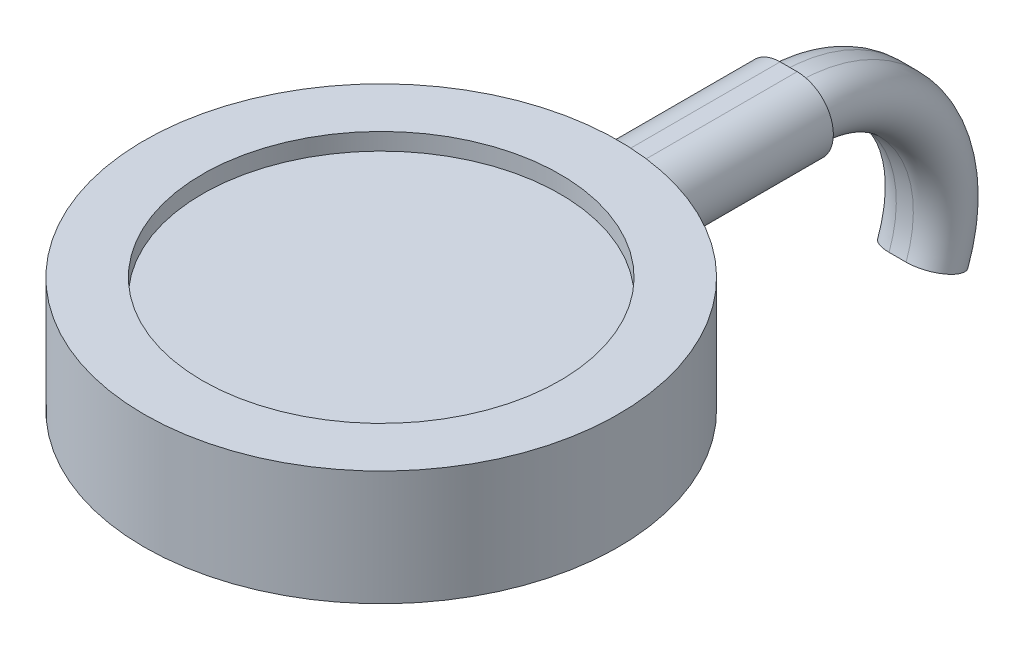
ISO-10303-21;
HEADER;
FILE_DESCRIPTION(('STEP AP214'),'2;1');
FILE_NAME('part.step','',(''),(''),'','','');
FILE_SCHEMA(('AUTOMOTIVE_DESIGN { 1 0 10303 214 1 1 1 1 }'));
ENDSEC;
DATA;
#1=APPLICATION_CONTEXT('core data for automotive mechanical design processes');
#2=APPLICATION_PROTOCOL_DEFINITION('international standard','automotive_design',2000,#1);
#3=PRODUCT_CONTEXT('',#1,'mechanical');
#4=PRODUCT('Part','Part','',(#3));
#5=PRODUCT_RELATED_PRODUCT_CATEGORY('part','',(#4));
#6=PRODUCT_DEFINITION_FORMATION('','',#4);
#7=PRODUCT_DEFINITION_CONTEXT('part definition',#1,'design');
#8=PRODUCT_DEFINITION('design','',#6,#7);
#9=PRODUCT_DEFINITION_SHAPE('','',#8);
#10=(LENGTH_UNIT() NAMED_UNIT(*) SI_UNIT(.MILLI.,.METRE.));
#11=(NAMED_UNIT(*) PLANE_ANGLE_UNIT() SI_UNIT($,.RADIAN.));
#12=(NAMED_UNIT(*) SI_UNIT($,.STERADIAN.) SOLID_ANGLE_UNIT());
#13=UNCERTAINTY_MEASURE_WITH_UNIT(LENGTH_MEASURE(1.E-05),#10,'distance_accuracy_value','');
#14=(GEOMETRIC_REPRESENTATION_CONTEXT(3) GLOBAL_UNCERTAINTY_ASSIGNED_CONTEXT((#13)) GLOBAL_UNIT_ASSIGNED_CONTEXT((#10,
#11,#12)) REPRESENTATION_CONTEXT('',''));
#15=CARTESIAN_POINT('',(0.,0.,0.));
#16=DIRECTION('',(0.,0.,1.));
#17=DIRECTION('',(1.,0.,0.));
#18=AXIS2_PLACEMENT_3D('',#15,#16,#17);
#19=CARTESIAN_POINT('',(0.,0.,-23.925));
#20=DIRECTION('',(0.,0.,-1.));
#21=DIRECTION('',(-1.,0.,0.));
#22=AXIS2_PLACEMENT_3D('',#19,#20,#21);
#23=PLANE('',#22);
#24=CARTESIAN_POINT('',(-0.5,0.,-23.925));
#25=DIRECTION('',(0.,0.,-1.));
#26=DIRECTION('',(-1.,0.,0.));
#27=AXIS2_PLACEMENT_3D('',#24,#25,#26);
#28=CIRCLE('',#27,2.125);
#29=CARTESIAN_POINT('',(-0.5,2.125,-23.925));
#30=VERTEX_POINT('',#29);
#31=CARTESIAN_POINT('',(-0.5,-2.125,-23.925));
#32=VERTEX_POINT('',#31);
#33=EDGE_CURVE('E140',#30,#32,#28,.F.);
#34=ORIENTED_EDGE('',*,*,#33,.F.);
#35=DIRECTION('',(1.,0.,0.));
#36=VECTOR('',#35,1.);
#37=CARTESIAN_POINT('',(-0.5,2.125,-23.925));
#38=LINE('',#37,#36);
#39=CARTESIAN_POINT('',(0.5,2.125,-23.925));
#40=VERTEX_POINT('',#39);
#41=EDGE_CURVE('E111',#30,#40,#38,.T.);
#42=ORIENTED_EDGE('',*,*,#41,.T.);
#43=CARTESIAN_POINT('',(0.5,0.,-23.925));
#44=DIRECTION('',(0.,0.,-1.));
#45=DIRECTION('',(-1.,0.,0.));
#46=AXIS2_PLACEMENT_3D('',#43,#44,#45);
#47=CIRCLE('',#46,2.125);
#48=CARTESIAN_POINT('',(0.500000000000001,-2.125,-23.925));
#49=VERTEX_POINT('',#48);
#50=EDGE_CURVE('E145',#49,#40,#47,.F.);
#51=ORIENTED_EDGE('',*,*,#50,.F.);
#52=DIRECTION('',(1.,0.,0.));
#53=VECTOR('',#52,1.);
#54=CARTESIAN_POINT('',(-0.5,-2.125,-23.925));
#55=LINE('',#54,#53);
#56=EDGE_CURVE('E150',#32,#49,#55,.T.);
#57=ORIENTED_EDGE('',*,*,#56,.F.);
#58=EDGE_LOOP('',(#34,#42,#51,#57));
#59=FACE_BOUND('',#58,.T.);
#60=DIRECTION('',(-1.,0.,0.));
#61=VECTOR('',#60,1.);
#62=CARTESIAN_POINT('',(0.5,-1.575,-23.925));
#63=LINE('',#62,#61);
#64=CARTESIAN_POINT('',(0.5,-1.575,-23.925));
#65=VERTEX_POINT('',#64);
#66=CARTESIAN_POINT('',(-0.5,-1.575,-23.925));
#67=VERTEX_POINT('',#66);
#68=EDGE_CURVE('E105',#65,#67,#63,.T.);
#69=ORIENTED_EDGE('',*,*,#68,.F.);
#70=CARTESIAN_POINT('',(0.5,0.,-23.925));
#71=DIRECTION('',(0.,0.,-1.));
#72=DIRECTION('',(-1.,0.,0.));
#73=AXIS2_PLACEMENT_3D('',#70,#71,#72);
#74=CIRCLE('',#73,1.575);
#75=CARTESIAN_POINT('',(0.5,1.575,-23.925));
#76=VERTEX_POINT('',#75);
#77=EDGE_CURVE('E115',#76,#65,#74,.T.);
#78=ORIENTED_EDGE('',*,*,#77,.F.);
#79=DIRECTION('',(1.,0.,0.));
#80=VECTOR('',#79,1.);
#81=CARTESIAN_POINT('',(0.5,1.575,-23.925));
#82=LINE('',#81,#80);
#83=CARTESIAN_POINT('',(-0.499999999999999,1.575,-23.925));
#84=VERTEX_POINT('',#83);
#85=EDGE_CURVE('E123',#84,#76,#82,.T.);
#86=ORIENTED_EDGE('',*,*,#85,.F.);
#87=CARTESIAN_POINT('',(-0.5,0.,-23.925));
#88=DIRECTION('',(0.,0.,-1.));
#89=DIRECTION('',(-1.,0.,0.));
#90=AXIS2_PLACEMENT_3D('',#87,#88,#89);
#91=CIRCLE('',#90,1.575);
#92=EDGE_CURVE('E53',#67,#84,#91,.T.);
#93=ORIENTED_EDGE('',*,*,#92,.F.);
#94=EDGE_LOOP('',(#69,#78,#86,#93));
#95=FACE_BOUND('',#94,.T.);
#96=ADVANCED_FACE('F34',(#59,#95),#23,.T.);
#97=CARTESIAN_POINT('',(0.,3.375,0.));
#98=DIRECTION('',(0.,-1.,0.));
#99=DIRECTION('',(0.,0.,-1.));
#100=AXIS2_PLACEMENT_3D('',#97,#98,#99);
#101=CYLINDRICAL_SURFACE('',#100,13.925);
#102=CARTESIAN_POINT('',(0.,2.125,0.));
#103=DIRECTION('',(0.,-1.,0.));
#104=DIRECTION('',(0.,0.,-1.));
#105=AXIS2_PLACEMENT_3D('',#102,#103,#104);
#106=CIRCLE('',#105,13.925);
#107=CARTESIAN_POINT('',(-0.5,2.125,-13.9160204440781));
#108=VERTEX_POINT('',#107);
#109=CARTESIAN_POINT('',(0.5,2.125,-13.9160204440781));
#110=VERTEX_POINT('',#109);
#111=EDGE_CURVE('E172',#108,#110,#106,.T.);
#112=ORIENTED_EDGE('',*,*,#111,.F.);
#113=CARTESIAN_POINT('',(0.,2.06533895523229,-13.925));
#114=CARTESIAN_POINT('',(-0.1150638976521,2.09318994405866,-13.924998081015));
#115=CARTESIAN_POINT('',(-0.23252616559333,2.11141849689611,-13.9235590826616));
#116=CARTESIAN_POINT('',(-0.468841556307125,2.1280766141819,-13.9176079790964));
#117=CARTESIAN_POINT('',(-0.587695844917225,2.12648818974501,-13.9130930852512));
#118=CARTESIAN_POINT('',(-0.823265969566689,2.10359578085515,-13.9011422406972));
#119=CARTESIAN_POINT('',(-0.939983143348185,2.08230459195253,-13.8937081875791));
#120=CARTESIAN_POINT('',(-1.1680702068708,2.02070866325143,-13.8763946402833));
#121=CARTESIAN_POINT('',(-1.27944078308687,1.98040637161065,-13.8665154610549));
#122=CARTESIAN_POINT('',(-1.49450048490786,1.88166987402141,-13.8449938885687));
#123=CARTESIAN_POINT('',(-1.59813687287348,1.8231231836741,-13.8333407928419));
#124=CARTESIAN_POINT('',(-1.79415664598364,1.68962954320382,-13.809286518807));
#125=CARTESIAN_POINT('',(-1.88653886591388,1.61468089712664,-13.7968852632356));
#126=CARTESIAN_POINT('',(-2.05854002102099,1.44946860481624,-13.7722796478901));
#127=CARTESIAN_POINT('',(-2.13800013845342,1.3590389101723,-13.7600791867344));
#128=CARTESIAN_POINT('',(-2.28061350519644,1.16595232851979,-13.7371634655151));
#129=CARTESIAN_POINT('',(-2.34376689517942,1.06329554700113,-13.7264481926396));
#130=CARTESIAN_POINT('',(-2.45177705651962,0.848861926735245,-13.7075682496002));
#131=CARTESIAN_POINT('',(-2.4966781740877,0.737107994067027,-13.6993974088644));
#132=CARTESIAN_POINT('',(-2.56701160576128,0.507450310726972,-13.6863935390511));
#133=CARTESIAN_POINT('',(-2.5924461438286,0.389547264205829,-13.6815601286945));
#134=CARTESIAN_POINT('',(-2.62279293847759,0.152912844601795,-13.6757749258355));
#135=CARTESIAN_POINT('',(-2.62801966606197,0.0342232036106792,-13.6747636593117));
#136=CARTESIAN_POINT('',(-2.61865403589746,-0.202337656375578,-13.6765601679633));
#137=CARTESIAN_POINT('',(-2.60406269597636,-0.320208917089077,-13.6793677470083));
#138=CARTESIAN_POINT('',(-2.55572283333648,-0.550816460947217,-13.6884804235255));
#139=CARTESIAN_POINT('',(-2.52212868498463,-0.663586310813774,-13.6947573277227));
#140=CARTESIAN_POINT('',(-2.43691429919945,-0.881884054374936,-13.7101764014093));
#141=CARTESIAN_POINT('',(-2.385292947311,-0.987411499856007,-13.719318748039));
#142=CARTESIAN_POINT('',(-2.26487135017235,-1.18946749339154,-13.7397138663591));
#143=CARTESIAN_POINT('',(-2.19589452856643,-1.28588860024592,-13.7509880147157));
#144=CARTESIAN_POINT('',(-2.04297008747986,-1.46588464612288,-13.7745369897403));
#145=CARTESIAN_POINT('',(-1.95902107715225,-1.54945839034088,-13.7868119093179));
#146=CARTESIAN_POINT('',(-1.77708008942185,-1.70265682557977,-13.8114498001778));
#147=CARTESIAN_POINT('',(-1.67889935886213,-1.77205775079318,-13.8238114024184));
#148=CARTESIAN_POINT('',(-1.47214637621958,-1.89338932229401,-13.8473542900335));
#149=CARTESIAN_POINT('',(-1.36357410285,-1.94531993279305,-13.8585355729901));
#150=CARTESIAN_POINT('',(-1.13904824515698,-2.03018331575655,-13.8787927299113));
#151=CARTESIAN_POINT('',(-1.02309456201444,-2.06311583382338,-13.8878685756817));
#152=CARTESIAN_POINT('',(-0.787115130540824,-2.10894124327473,-13.90323865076));
#153=CARTESIAN_POINT('',(-0.667089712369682,-2.1218357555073,-13.9095331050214));
#154=CARTESIAN_POINT('',(-0.427928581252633,-2.12710218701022,-13.9189314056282));
#155=CARTESIAN_POINT('',(-0.308799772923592,-2.11972151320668,-13.9220730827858));
#156=CARTESIAN_POINT('',(-0.0734156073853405,-2.08513783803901,-13.9253040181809));
#157=CARTESIAN_POINT('',(0.0428398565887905,-2.05793557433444,-13.9253933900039));
#158=CARTESIAN_POINT('',(0.268415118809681,-1.98472579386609,-13.9228672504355));
#159=CARTESIAN_POINT('',(0.377774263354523,-1.9388387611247,-13.92026890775));
#160=CARTESIAN_POINT('',(0.587302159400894,-1.82957929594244,-13.9130048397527));
#161=CARTESIAN_POINT('',(0.687470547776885,-1.76620617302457,-13.9083390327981));
#162=CARTESIAN_POINT('',(0.876432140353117,-1.62332233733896,-13.8977162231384));
#163=CARTESIAN_POINT('',(0.965152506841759,-1.54371588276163,-13.8917515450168));
#164=CARTESIAN_POINT('',(1.12805607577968,-1.3708270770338,-13.8794741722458));
#165=CARTESIAN_POINT('',(1.20223866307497,-1.27754414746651,-13.8731614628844));
#166=CARTESIAN_POINT('',(1.33446591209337,-1.07919542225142,-13.8610706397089));
#167=CARTESIAN_POINT('',(1.39239593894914,-0.974052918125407,-13.8552965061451));
#168=CARTESIAN_POINT('',(1.48977575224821,-0.755468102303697,-13.8451653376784));
#169=CARTESIAN_POINT('',(1.529225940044,-0.642025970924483,-13.8408082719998));
#170=CARTESIAN_POINT('',(1.58841462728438,-0.410369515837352,-13.8341410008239));
#171=CARTESIAN_POINT('',(1.60820480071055,-0.292168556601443,-13.8318254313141));
#172=CARTESIAN_POINT('',(1.62766549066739,-0.0541013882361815,-13.8295491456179));
#173=CARTESIAN_POINT('',(1.62733675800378,0.0657647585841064,-13.8295883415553));
#174=CARTESIAN_POINT('',(1.60663150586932,0.303034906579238,-13.8320086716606));
#175=CARTESIAN_POINT('',(1.58636941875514,0.420449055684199,-13.8343764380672));
#176=CARTESIAN_POINT('',(1.52656392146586,0.650195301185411,-13.8411027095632));
#177=CARTESIAN_POINT('',(1.48702070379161,0.762527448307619,-13.8454611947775));
#178=CARTESIAN_POINT('',(1.38969540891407,0.979187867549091,-13.8555677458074));
#179=CARTESIAN_POINT('',(1.33187738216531,1.08349985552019,-13.8613185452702));
#180=CARTESIAN_POINT('',(1.19963911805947,1.2810066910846,-13.873387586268));
#181=CARTESIAN_POINT('',(1.1252149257,1.37419888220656,-13.8797059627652));
#182=CARTESIAN_POINT('',(0.961318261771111,1.5474125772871,-13.8920220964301));
#183=CARTESIAN_POINT('',(0.871752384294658,1.62734582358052,-13.8980175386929));
#184=CARTESIAN_POINT('',(0.680463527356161,1.77099111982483,-13.9086925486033));
#185=CARTESIAN_POINT('',(0.578752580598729,1.83471903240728,-13.9133734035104));
#186=CARTESIAN_POINT('',(0.397563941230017,1.92798090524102,-13.919525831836));
#187=CARTESIAN_POINT('',(0.320402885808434,1.96205396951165,-13.9215370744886));
#188=CARTESIAN_POINT('',(0.162566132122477,2.02082223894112,-13.9242748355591));
#189=CARTESIAN_POINT('',(0.0818904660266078,2.04551752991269,-13.9250013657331));
#190=CARTESIAN_POINT('',(0.,2.06533895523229,-13.925));
#191=B_SPLINE_CURVE_WITH_KNOTS('',3,(#113,#114,#115,#116,#117,#118,#119,#120,#121,#122,#123,
#124,#125,#126,#127,#128,#129,#130,#131,#132,#133,#134,#135,#136,#137,#138,#139,#140,#141,#142,
#143,#144,#145,#146,#147,#148,#149,#150,#151,#152,#153,#154,#155,#156,#157,#158,#159,#160,#161,
#162,#163,#164,#165,#166,#167,#168,#169,#170,#171,#172,#173,#174,#175,#176,#177,#178,#179,#180,
#181,#182,#183,#184,#185,#186,#187,#188,#189,#190),.UNSPECIFIED.,.T.,.F.,(4,2,2,2,2,2,2,2,2,2,2,
2,2,2,2,2,2,2,2,2,2,2,2,2,2,2,2,2,2,2,2,2,2,2,2,2,2,2,4),(0.,0.354853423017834,
0.710028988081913,1.06497405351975,1.41987342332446,1.77700569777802,2.13417491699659,
2.49544732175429,2.85671660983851,3.21710282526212,3.57744786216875,3.93216214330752,
4.2868582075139,4.63871335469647,4.99059025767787,5.34620318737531,5.70184916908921,
6.0627373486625,6.42362626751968,6.78452001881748,7.14538457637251,7.5018653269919,
7.85833281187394,8.21253721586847,8.5667556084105,8.9231269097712,9.27951328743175,
9.63835356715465,9.99718605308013,10.3550728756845,10.7129463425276,11.068777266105,
11.4246046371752,11.7811363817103,12.1377531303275,12.496655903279,12.8552059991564,
13.1077559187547,13.3603035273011),.UNSPECIFIED.);
#192=CARTESIAN_POINT('',(-0.5,-2.125,-13.9160204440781));
#193=VERTEX_POINT('',#192);
#194=EDGE_CURVE('E12',#108,#193,#191,.T.);
#195=ORIENTED_EDGE('',*,*,#194,.T.);
#196=CARTESIAN_POINT('',(0.,-2.125,0.));
#197=DIRECTION('',(0.,-1.,0.));
#198=DIRECTION('',(0.,0.,-1.));
#199=AXIS2_PLACEMENT_3D('',#196,#197,#198);
#200=CIRCLE('',#199,13.925);
#201=CARTESIAN_POINT('',(0.500000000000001,-2.125,-13.9160204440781));
#202=VERTEX_POINT('',#201);
#203=EDGE_CURVE('E46',#193,#202,#200,.T.);
#204=ORIENTED_EDGE('',*,*,#203,.T.);
#205=CARTESIAN_POINT('',(0.,2.06533895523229,-13.925));
#206=CARTESIAN_POINT('',(-0.115595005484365,2.03734943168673,-13.9249984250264));
#207=CARTESIAN_POINT('',(-0.228902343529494,1.99961563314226,-13.92354662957));
#208=CARTESIAN_POINT('',(-0.447638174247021,1.90572838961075,-13.9182347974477));
#209=CARTESIAN_POINT('',(-0.553058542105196,1.84955626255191,-13.9143723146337));
#210=CARTESIAN_POINT('',(-0.752902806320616,1.72046366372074,-13.9049908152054));
#211=CARTESIAN_POINT('',(-0.847334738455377,1.64755554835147,-13.8994730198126));
#212=CARTESIAN_POINT('',(-1.0226521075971,1.48703780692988,-13.8876759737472));
#213=CARTESIAN_POINT('',(-1.10353980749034,1.39943064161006,-13.8813968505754));
#214=CARTESIAN_POINT('',(-1.24997007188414,1.21140675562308,-13.8689813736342));
#215=CARTESIAN_POINT('',(-1.31542428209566,1.11092113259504,-13.8628460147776));
#216=CARTESIAN_POINT('',(-1.42855071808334,0.900334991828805,-13.8516466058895));
#217=CARTESIAN_POINT('',(-1.47622264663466,0.790234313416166,-13.8465825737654));
#218=CARTESIAN_POINT('',(-1.55238517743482,0.563582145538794,-13.8382514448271));
#219=CARTESIAN_POINT('',(-1.58088565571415,0.447034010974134,-13.8349834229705));
#220=CARTESIAN_POINT('',(-1.61789957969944,0.210767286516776,-13.8307042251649));
#221=CARTESIAN_POINT('',(-1.62641389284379,0.0910488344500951,-13.8296929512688));
#222=CARTESIAN_POINT('',(-1.62321301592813,-0.147366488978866,-13.8300688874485));
#223=CARTESIAN_POINT('',(-1.61162314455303,-0.26606508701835,-13.8314412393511));
#224=CARTESIAN_POINT('',(-1.56879871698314,-0.499815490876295,-13.836363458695));
#225=CARTESIAN_POINT('',(-1.53756408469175,-0.614867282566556,-13.8399133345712));
#226=CARTESIAN_POINT('',(-1.45635769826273,-0.838091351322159,-13.8486932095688));
#227=CARTESIAN_POINT('',(-1.40638484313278,-0.946263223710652,-13.8539233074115));
#228=CARTESIAN_POINT('',(-1.28912136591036,-1.15272078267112,-13.86532535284));
#229=CARTESIAN_POINT('',(-1.22182993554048,-1.25100600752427,-13.8714973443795));
#230=CARTESIAN_POINT('',(-1.07133086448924,-1.43555173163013,-13.8839329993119));
#231=CARTESIAN_POINT('',(-0.988026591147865,-1.52173342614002,-13.8901969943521));
#232=CARTESIAN_POINT('',(-0.808098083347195,-1.67892069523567,-13.9018240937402));
#233=CARTESIAN_POINT('',(-0.711473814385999,-1.74992623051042,-13.9071871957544));
#234=CARTESIAN_POINT('',(-0.507562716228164,-1.87476367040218,-13.9161204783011));
#235=CARTESIAN_POINT('',(-0.40027109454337,-1.92858780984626,-13.9196898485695));
#236=CARTESIAN_POINT('',(-0.17812054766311,-2.01744561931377,-13.9243034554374));
#237=CARTESIAN_POINT('',(-0.0632620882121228,-2.05248044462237,-13.9253478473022));
#238=CARTESIAN_POINT('',(0.169752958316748,-2.10253367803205,-13.9244485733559));
#239=CARTESIAN_POINT('',(0.287875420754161,-2.11771144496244,-13.922528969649));
#240=CARTESIAN_POINT('',(0.524904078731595,-2.12816284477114,-13.9156083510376));
#241=CARTESIAN_POINT('',(0.643810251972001,-2.123437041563,-13.9106074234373));
#242=CARTESIAN_POINT('',(0.878575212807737,-2.09433649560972,-13.8977517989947));
#243=CARTESIAN_POINT('',(0.994443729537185,-2.07003526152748,-13.889907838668));
#244=CARTESIAN_POINT('',(1.22038703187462,-2.00264029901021,-13.8718828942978));
#245=CARTESIAN_POINT('',(1.33046148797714,-1.95954550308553,-13.8617017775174));
#246=CARTESIAN_POINT('',(1.54279365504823,-1.85534850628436,-13.8396863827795));
#247=CARTESIAN_POINT('',(1.64497183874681,-1.79408727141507,-13.8278380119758));
#248=CARTESIAN_POINT('',(1.8376428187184,-1.65542348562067,-13.8035552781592));
#249=CARTESIAN_POINT('',(1.92813467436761,-1.57801963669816,-13.7911208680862));
#250=CARTESIAN_POINT('',(2.09589755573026,-1.40823733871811,-13.7666305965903));
#251=CARTESIAN_POINT('',(2.17301308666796,-1.31570430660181,-13.7545803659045));
#252=CARTESIAN_POINT('',(2.31060699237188,-1.11881641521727,-13.7321373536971));
#253=CARTESIAN_POINT('',(2.371085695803,-1.01446178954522,-13.7217445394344));
#254=CARTESIAN_POINT('',(2.47341444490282,-0.79725532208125,-13.7036691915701));
#255=CARTESIAN_POINT('',(2.51533524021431,-0.684437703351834,-13.695976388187));
#256=CARTESIAN_POINT('',(2.57957868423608,-0.453182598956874,-13.6840227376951));
#257=CARTESIAN_POINT('',(2.60190358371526,-0.334745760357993,-13.6797614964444));
#258=CARTESIAN_POINT('',(2.62604567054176,-0.0976298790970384,-13.675147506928));
#259=CARTESIAN_POINT('',(2.62818277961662,0.0210154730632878,-13.6747337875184));
#260=CARTESIAN_POINT('',(2.61271685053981,0.25695993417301,-13.6776970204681));
#261=CARTESIAN_POINT('',(2.59511462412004,0.374259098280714,-13.6810738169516));
#262=CARTESIAN_POINT('',(2.54090956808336,0.603393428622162,-13.6912435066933));
#263=CARTESIAN_POINT('',(2.50443343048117,0.715259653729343,-13.6980136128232));
#264=CARTESIAN_POINT('',(2.41364986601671,0.93128924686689,-13.7143003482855));
#265=CARTESIAN_POINT('',(2.35934120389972,1.03545208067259,-13.7238171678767));
#266=CARTESIAN_POINT('',(2.23370832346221,1.23445914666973,-13.7448267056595));
#267=CARTESIAN_POINT('',(2.16219204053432,1.32917978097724,-13.7563412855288));
#268=CARTESIAN_POINT('',(2.00448213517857,1.50537038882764,-13.7802040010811));
#269=CARTESIAN_POINT('',(1.91828761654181,1.58683955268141,-13.7925521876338));
#270=CARTESIAN_POINT('',(1.7322428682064,1.73538723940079,-13.8171585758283));
#271=CARTESIAN_POINT('',(1.63221811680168,1.80224797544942,-13.8294130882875));
#272=CARTESIAN_POINT('',(1.42218839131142,1.91822429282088,-13.8525864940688));
#273=CARTESIAN_POINT('',(1.31218154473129,1.96733653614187,-13.8635051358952));
#274=CARTESIAN_POINT('',(1.08539291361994,2.046300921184,-13.8831007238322));
#275=CARTESIAN_POINT('',(0.968617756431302,2.07617156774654,-13.8917798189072));
#276=CARTESIAN_POINT('',(0.731608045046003,2.115747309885,-13.9062728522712));
#277=CARTESIAN_POINT('',(0.61137729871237,2.12547379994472,-13.9120898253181));
#278=CARTESIAN_POINT('',(0.40856223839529,2.12464344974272,-13.9192521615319));
#279=CARTESIAN_POINT('',(0.325946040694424,2.11947201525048,-13.9214266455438));
#280=CARTESIAN_POINT('',(0.161851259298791,2.09955019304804,-13.9243011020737));
#281=CARTESIAN_POINT('',(0.080372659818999,2.08479993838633,-13.9250010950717));
#282=CARTESIAN_POINT('',(0.,2.06533895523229,-13.925));
#283=B_SPLINE_CURVE_WITH_KNOTS('',3,(#205,#206,#207,#208,#209,#210,#211,#212,#213,#214,#215,
#216,#217,#218,#219,#220,#221,#222,#223,#224,#225,#226,#227,#228,#229,#230,#231,#232,#233,#234,
#235,#236,#237,#238,#239,#240,#241,#242,#243,#244,#245,#246,#247,#248,#249,#250,#251,#252,#253,
#254,#255,#256,#257,#258,#259,#260,#261,#262,#263,#264,#265,#266,#267,#268,#269,#270,#271,#272,
#273,#274,#275,#276,#277,#278,#279,#280,#281,#282),.UNSPECIFIED.,.T.,.F.,(4,2,2,2,2,2,2,2,2,2,2,
2,2,2,2,2,2,2,2,2,2,2,2,2,2,2,2,2,2,2,2,2,2,2,2,2,2,2,4),(0.,0.356503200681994,
0.713368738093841,1.06997163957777,1.42651490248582,1.78505228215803,2.14359565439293,
2.50195418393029,2.86029715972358,3.21641443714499,3.57253309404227,3.92867267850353,
4.28482888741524,4.64320599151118,5.00158402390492,5.3601237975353,5.71864152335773,
6.07426402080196,6.42987644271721,6.78415967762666,7.13846303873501,7.49596454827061,
7.85349481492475,8.21493713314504,8.57637231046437,8.93641743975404,9.29642120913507,
9.65071013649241,10.0049844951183,10.3569110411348,10.7088619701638,11.0649400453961,
11.4210398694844,11.7821325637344,12.1432931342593,12.5041058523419,12.8645351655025,
13.112413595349,13.360288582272),.UNSPECIFIED.);
#284=EDGE_CURVE('E177',#202,#110,#283,.T.);
#285=ORIENTED_EDGE('',*,*,#284,.T.);
#286=EDGE_LOOP('',(#112,#195,#204,#285));
#287=FACE_BOUND('',#286,.T.);
#288=CARTESIAN_POINT('',(0.,3.375,0.));
#289=DIRECTION('',(0.,1.,0.));
#290=DIRECTION('',(0.,0.,1.));
#291=AXIS2_PLACEMENT_3D('',#288,#289,#290);
#292=CIRCLE('',#291,13.925);
#293=CARTESIAN_POINT('',(0.,3.375,13.925));
#294=VERTEX_POINT('',#293);
#295=EDGE_CURVE('E169',#294,#294,#292,.T.);
#296=ORIENTED_EDGE('',*,*,#295,.F.);
#297=EDGE_LOOP('',(#296));
#298=FACE_BOUND('',#297,.T.);
#299=CARTESIAN_POINT('',(0.,-3.375,0.));
#300=DIRECTION('',(0.,1.,0.));
#301=DIRECTION('',(0.,0.,1.));
#302=AXIS2_PLACEMENT_3D('',#299,#300,#301);
#303=CIRCLE('',#302,13.925);
#304=CARTESIAN_POINT('',(0.,-3.375,13.925));
#305=VERTEX_POINT('',#304);
#306=EDGE_CURVE('E166',#305,#305,#303,.T.);
#307=ORIENTED_EDGE('',*,*,#306,.T.);
#308=EDGE_LOOP('',(#307));
#309=FACE_BOUND('',#308,.T.);
#310=ADVANCED_FACE('F36',(#287,#298,#309),#101,.T.);
#311=CARTESIAN_POINT('',(0.,3.375,0.));
#312=DIRECTION('',(0.,1.,0.));
#313=DIRECTION('',(0.,0.,1.));
#314=AXIS2_PLACEMENT_3D('',#311,#312,#313);
#315=PLANE('',#314);
#316=CARTESIAN_POINT('',(0.,3.375,0.));
#317=DIRECTION('',(0.,1.,0.));
#318=DIRECTION('',(0.,0.,1.));
#319=AXIS2_PLACEMENT_3D('',#316,#317,#318);
#320=CIRCLE('',#319,10.5);
#321=CARTESIAN_POINT('',(0.,3.375,10.5));
#322=VERTEX_POINT('',#321);
#323=EDGE_CURVE('E162',#322,#322,#320,.T.);
#324=ORIENTED_EDGE('',*,*,#323,.F.);
#325=EDGE_LOOP('',(#324));
#326=FACE_BOUND('',#325,.T.);
#327=ORIENTED_EDGE('',*,*,#295,.T.);
#328=EDGE_LOOP('',(#327));
#329=FACE_BOUND('',#328,.T.);
#330=ADVANCED_FACE('F209',(#326,#329),#315,.T.);
#331=CARTESIAN_POINT('',(0.,-3.375,0.));
#332=DIRECTION('',(0.,1.,0.));
#333=DIRECTION('',(0.,0.,1.));
#334=AXIS2_PLACEMENT_3D('',#331,#332,#333);
#335=PLANE('',#334);
#336=ORIENTED_EDGE('',*,*,#306,.F.);
#337=EDGE_LOOP('',(#336));
#338=FACE_BOUND('',#337,.T.);
#339=ADVANCED_FACE('F207',(#338),#335,.F.);
#340=CARTESIAN_POINT('',(0.,2.375,0.));
#341=DIRECTION('',(0.,1.,0.));
#342=DIRECTION('',(0.,0.,1.));
#343=AXIS2_PLACEMENT_3D('',#340,#341,#342);
#344=CYLINDRICAL_SURFACE('',#343,10.5);
#345=CARTESIAN_POINT('',(0.,2.375,0.));
#346=DIRECTION('',(0.,1.,0.));
#347=DIRECTION('',(0.,0.,1.));
#348=AXIS2_PLACEMENT_3D('',#345,#346,#347);
#349=CIRCLE('',#348,10.5);
#350=CARTESIAN_POINT('',(0.,2.375,10.5));
#351=VERTEX_POINT('',#350);
#352=EDGE_CURVE('E163',#351,#351,#349,.T.);
#353=ORIENTED_EDGE('',*,*,#352,.F.);
#354=EDGE_LOOP('',(#353));
#355=FACE_BOUND('',#354,.T.);
#356=ORIENTED_EDGE('',*,*,#323,.T.);
#357=EDGE_LOOP('',(#356));
#358=FACE_BOUND('',#357,.T.);
#359=ADVANCED_FACE('F203',(#355,#358),#344,.F.);
#360=CARTESIAN_POINT('',(0.,2.375,0.));
#361=DIRECTION('',(0.,1.,0.));
#362=DIRECTION('',(0.,0.,1.));
#363=AXIS2_PLACEMENT_3D('',#360,#361,#362);
#364=PLANE('',#363);
#365=ORIENTED_EDGE('',*,*,#352,.T.);
#366=EDGE_LOOP('',(#365));
#367=FACE_BOUND('',#366,.T.);
#368=ADVANCED_FACE('F196',(#367),#364,.T.);
#369=CARTESIAN_POINT('',(-0.5,0.,-40.6796280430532));
#370=DIRECTION('',(0.,0.,1.));
#371=DIRECTION('',(1.,0.,0.));
#372=AXIS2_PLACEMENT_3D('',#369,#370,#371);
#373=CYLINDRICAL_SURFACE('',#372,2.125);
#374=ORIENTED_EDGE('',*,*,#194,.F.);
#375=DIRECTION('',(0.,0.,1.));
#376=VECTOR('',#375,1.);
#377=CARTESIAN_POINT('',(-0.5,2.125,-40.6796280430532));
#378=LINE('',#377,#376);
#379=EDGE_CURVE('E155',#30,#108,#378,.T.);
#380=ORIENTED_EDGE('',*,*,#379,.F.);
#381=ORIENTED_EDGE('',*,*,#33,.T.);
#382=DIRECTION('',(0.,0.,1.));
#383=VECTOR('',#382,1.);
#384=CARTESIAN_POINT('',(-0.5,-2.125,-40.6796280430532));
#385=LINE('',#384,#383);
#386=EDGE_CURVE('E143',#32,#193,#385,.T.);
#387=ORIENTED_EDGE('',*,*,#386,.T.);
#388=EDGE_LOOP('',(#374,#380,#381,#387));
#389=FACE_BOUND('',#388,.T.);
#390=ADVANCED_FACE('F187',(#389),#373,.T.);
#391=CARTESIAN_POINT('',(0.5,0.,-40.6796280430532));
#392=DIRECTION('',(0.,0.,1.));
#393=DIRECTION('',(1.,0.,0.));
#394=AXIS2_PLACEMENT_3D('',#391,#392,#393);
#395=CYLINDRICAL_SURFACE('',#394,2.125);
#396=ORIENTED_EDGE('',*,*,#284,.F.);
#397=DIRECTION('',(0.,0.,1.));
#398=VECTOR('',#397,1.);
#399=CARTESIAN_POINT('',(0.500000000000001,-2.125,-40.6796280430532));
#400=LINE('',#399,#398);
#401=EDGE_CURVE('E149',#49,#202,#400,.T.);
#402=ORIENTED_EDGE('',*,*,#401,.F.);
#403=ORIENTED_EDGE('',*,*,#50,.T.);
#404=DIRECTION('',(0.,0.,1.));
#405=VECTOR('',#404,1.);
#406=CARTESIAN_POINT('',(0.5,2.125,-40.6796280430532));
#407=LINE('',#406,#405);
#408=EDGE_CURVE('E148',#40,#110,#407,.T.);
#409=ORIENTED_EDGE('',*,*,#408,.T.);
#410=EDGE_LOOP('',(#396,#402,#403,#409));
#411=FACE_BOUND('',#410,.T.);
#412=ADVANCED_FACE('F181',(#411),#395,.T.);
#413=CARTESIAN_POINT('',(-0.5,-2.125,-40.6796280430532));
#414=DIRECTION('',(0.,-1.,0.));
#415=DIRECTION('',(0.,0.,-1.));
#416=AXIS2_PLACEMENT_3D('',#413,#414,#415);
#417=PLANE('',#416);
#418=ORIENTED_EDGE('',*,*,#203,.F.);
#419=ORIENTED_EDGE('',*,*,#386,.F.);
#420=ORIENTED_EDGE('',*,*,#56,.T.);
#421=ORIENTED_EDGE('',*,*,#401,.T.);
#422=EDGE_LOOP('',(#418,#419,#420,#421));
#423=FACE_BOUND('',#422,.T.);
#424=ADVANCED_FACE('F186',(#423),#417,.T.);
#425=CARTESIAN_POINT('',(-0.5,2.125,-40.6796280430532));
#426=DIRECTION('',(0.,-1.,0.));
#427=DIRECTION('',(0.,0.,-1.));
#428=AXIS2_PLACEMENT_3D('',#425,#426,#427);
#429=PLANE('',#428);
#430=ORIENTED_EDGE('',*,*,#379,.T.);
#431=ORIENTED_EDGE('',*,*,#111,.T.);
#432=ORIENTED_EDGE('',*,*,#408,.F.);
#433=ORIENTED_EDGE('',*,*,#41,.F.);
#434=EDGE_LOOP('',(#430,#431,#432,#433));
#435=FACE_BOUND('',#434,.T.);
#436=ADVANCED_FACE('F189',(#435),#429,.F.);
#437=CARTESIAN_POINT('',(0.5,-8.39592922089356,-23.925));
#438=DIRECTION('',(1.,0.,0.));
#439=DIRECTION('',(0.,0.,-1.));
#440=AXIS2_PLACEMENT_3D('',#437,#438,#439);
#441=TOROIDAL_SURFACE('',#440,8.39592922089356,1.575);
#442=CARTESIAN_POINT('',(0.5,-8.39592922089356,-23.925));
#443=DIRECTION('',(1.,0.,0.));
#444=DIRECTION('',(0.,0.,-1.));
#445=AXIS2_PLACEMENT_3D('',#442,#443,#444);
#446=CIRCLE('',#445,6.82092922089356);
#447=CARTESIAN_POINT('',(0.5,-10.7620661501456,-30.3223800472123));
#448=VERTEX_POINT('',#447);
#449=EDGE_CURVE('E101',#448,#65,#446,.T.);
#450=ORIENTED_EDGE('',*,*,#449,.F.);
#451=CARTESIAN_POINT('',(0.5,-11.3084236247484,-31.7995795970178));
#452=DIRECTION('',(0.,-0.937904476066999,0.346893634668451));
#453=DIRECTION('',(-1.,0.,0.));
#454=AXIS2_PLACEMENT_3D('',#451,#452,#453);
#455=CIRCLE('',#454,1.575);
#456=CARTESIAN_POINT('',(0.5,-11.8547810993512,-33.2767791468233));
#457=VERTEX_POINT('',#456);
#458=EDGE_CURVE('E127',#457,#448,#455,.T.);
#459=ORIENTED_EDGE('',*,*,#458,.F.);
#460=CARTESIAN_POINT('',(0.5,-8.39592922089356,-23.925));
#461=DIRECTION('',(1.,0.,0.));
#462=DIRECTION('',(0.,0.,-1.));
#463=AXIS2_PLACEMENT_3D('',#460,#461,#462);
#464=CIRCLE('',#463,9.97092922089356);
#465=EDGE_CURVE('E117',#457,#76,#464,.T.);
#466=ORIENTED_EDGE('',*,*,#465,.T.);
#467=ORIENTED_EDGE('',*,*,#77,.T.);
#468=EDGE_LOOP('',(#450,#459,#466,#467));
#469=FACE_BOUND('',#468,.T.);
#470=ADVANCED_FACE('F116',(#469),#441,.T.);
#471=CARTESIAN_POINT('',(0.,-8.39592922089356,-23.925));
#472=DIRECTION('',(1.,0.,0.));
#473=DIRECTION('',(0.,0.,-1.));
#474=AXIS2_PLACEMENT_3D('',#471,#472,#473);
#475=CYLINDRICAL_SURFACE('',#474,6.82092922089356);
#476=CARTESIAN_POINT('',(-0.5,-8.39592922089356,-23.925));
#477=DIRECTION('',(1.,0.,0.));
#478=DIRECTION('',(0.,0.,-1.));
#479=AXIS2_PLACEMENT_3D('',#476,#477,#478);
#480=CIRCLE('',#479,6.82092922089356);
#481=CARTESIAN_POINT('',(-0.5,-10.7620661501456,-30.3223800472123));
#482=VERTEX_POINT('',#481);
#483=EDGE_CURVE('E112',#482,#67,#480,.T.);
#484=ORIENTED_EDGE('',*,*,#483,.F.);
#485=DIRECTION('',(-1.,0.,0.));
#486=VECTOR('',#485,1.);
#487=CARTESIAN_POINT('',(0.5,-10.7620661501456,-30.3223800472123));
#488=LINE('',#487,#486);
#489=EDGE_CURVE('E107',#448,#482,#488,.T.);
#490=ORIENTED_EDGE('',*,*,#489,.F.);
#491=ORIENTED_EDGE('',*,*,#449,.T.);
#492=ORIENTED_EDGE('',*,*,#68,.T.);
#493=EDGE_LOOP('',(#484,#490,#491,#492));
#494=FACE_BOUND('',#493,.T.);
#495=ADVANCED_FACE('F103',(#494),#475,.F.);
#496=CARTESIAN_POINT('',(-0.5,-8.39592922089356,-23.925));
#497=DIRECTION('',(1.,0.,0.));
#498=DIRECTION('',(0.,0.,-1.));
#499=AXIS2_PLACEMENT_3D('',#496,#497,#498);
#500=TOROIDAL_SURFACE('',#499,8.39592922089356,1.575);
#501=CARTESIAN_POINT('',(-0.499999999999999,-8.39592922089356,-23.925));
#502=DIRECTION('',(1.,0.,0.));
#503=DIRECTION('',(0.,0.,-1.));
#504=AXIS2_PLACEMENT_3D('',#501,#502,#503);
#505=CIRCLE('',#504,9.97092922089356);
#506=CARTESIAN_POINT('',(-0.499999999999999,-11.8547810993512,-33.2767791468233));
#507=VERTEX_POINT('',#506);
#508=EDGE_CURVE('E137',#507,#84,#505,.T.);
#509=ORIENTED_EDGE('',*,*,#508,.F.);
#510=CARTESIAN_POINT('',(-0.5,-11.3084236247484,-31.7995795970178));
#511=DIRECTION('',(0.,-0.937904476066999,0.346893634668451));
#512=DIRECTION('',(-1.,0.,0.));
#513=AXIS2_PLACEMENT_3D('',#510,#511,#512);
#514=CIRCLE('',#513,1.575);
#515=EDGE_CURVE('E130',#482,#507,#514,.T.);
#516=ORIENTED_EDGE('',*,*,#515,.F.);
#517=ORIENTED_EDGE('',*,*,#483,.T.);
#518=ORIENTED_EDGE('',*,*,#92,.T.);
#519=EDGE_LOOP('',(#509,#516,#517,#518));
#520=FACE_BOUND('',#519,.T.);
#521=ADVANCED_FACE('F239',(#520),#500,.T.);
#522=CARTESIAN_POINT('',(0.,-8.39592922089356,-23.925));
#523=DIRECTION('',(1.,0.,0.));
#524=DIRECTION('',(0.,0.,-1.));
#525=AXIS2_PLACEMENT_3D('',#522,#523,#524);
#526=CYLINDRICAL_SURFACE('',#525,9.97092922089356);
#527=DIRECTION('',(1.,0.,0.));
#528=VECTOR('',#527,1.);
#529=CARTESIAN_POINT('',(0.5,-11.8547810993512,-33.2767791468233));
#530=LINE('',#529,#528);
#531=EDGE_CURVE('E133',#507,#457,#530,.T.);
#532=ORIENTED_EDGE('',*,*,#531,.F.);
#533=ORIENTED_EDGE('',*,*,#508,.T.);
#534=ORIENTED_EDGE('',*,*,#85,.T.);
#535=ORIENTED_EDGE('',*,*,#465,.F.);
#536=EDGE_LOOP('',(#532,#533,#534,#535));
#537=FACE_BOUND('',#536,.T.);
#538=ADVANCED_FACE('F243',(#537),#526,.T.);
#539=CARTESIAN_POINT('',(0.5,-11.3084236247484,-31.7995795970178));
#540=DIRECTION('',(0.,-0.937904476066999,0.346893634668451));
#541=DIRECTION('',(-1.,0.,0.));
#542=AXIS2_PLACEMENT_3D('',#539,#540,#541);
#543=PLANE('',#542);
#544=ORIENTED_EDGE('',*,*,#458,.T.);
#545=ORIENTED_EDGE('',*,*,#489,.T.);
#546=ORIENTED_EDGE('',*,*,#515,.T.);
#547=ORIENTED_EDGE('',*,*,#531,.T.);
#548=EDGE_LOOP('',(#544,#545,#546,#547));
#549=FACE_BOUND('',#548,.T.);
#550=ADVANCED_FACE('F242',(#549),#543,.T.);
#551=CLOSED_SHELL('',(#96,#310,#330,#339,#359,#368,#390,#412,#424,#436,#470,#495,#521,#538,#550));
#552=MANIFOLD_SOLID_BREP('B2',#551);
#553=ADVANCED_BREP_SHAPE_REPRESENTATION('',(#18,#552),#14);
#554=SHAPE_DEFINITION_REPRESENTATION(#9,#553);
ENDSEC;
END-ISO-10303-21;
